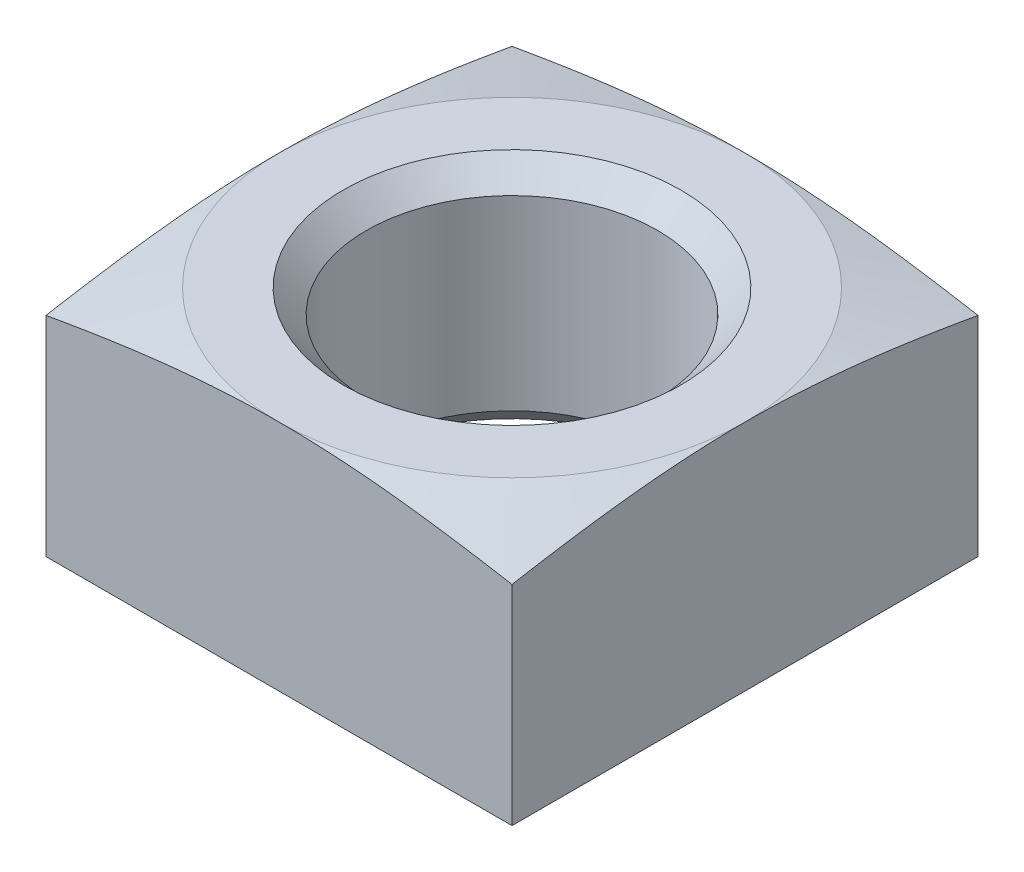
ISO-10303-21;
HEADER;
FILE_DESCRIPTION(('STEP AP214'),'2;1');
FILE_NAME('part.step','',(''),(''),'','','');
FILE_SCHEMA(('AUTOMOTIVE_DESIGN { 1 0 10303 214 1 1 1 1 }'));
ENDSEC;
DATA;
#1=APPLICATION_CONTEXT('core data for automotive mechanical design processes');
#2=APPLICATION_PROTOCOL_DEFINITION('international standard','automotive_design',2000,#1);
#3=PRODUCT_CONTEXT('',#1,'mechanical');
#4=PRODUCT('Part','Part','',(#3));
#5=PRODUCT_RELATED_PRODUCT_CATEGORY('part','',(#4));
#6=PRODUCT_DEFINITION_FORMATION('','',#4);
#7=PRODUCT_DEFINITION_CONTEXT('part definition',#1,'design');
#8=PRODUCT_DEFINITION('design','',#6,#7);
#9=PRODUCT_DEFINITION_SHAPE('','',#8);
#10=(LENGTH_UNIT() NAMED_UNIT(*) SI_UNIT(.MILLI.,.METRE.));
#11=(NAMED_UNIT(*) PLANE_ANGLE_UNIT() SI_UNIT($,.RADIAN.));
#12=(NAMED_UNIT(*) SI_UNIT($,.STERADIAN.) SOLID_ANGLE_UNIT());
#13=UNCERTAINTY_MEASURE_WITH_UNIT(LENGTH_MEASURE(1.E-05),#10,'distance_accuracy_value','');
#14=(GEOMETRIC_REPRESENTATION_CONTEXT(3) GLOBAL_UNCERTAINTY_ASSIGNED_CONTEXT((#13)) GLOBAL_UNIT_ASSIGNED_CONTEXT((#10,
#11,#12)) REPRESENTATION_CONTEXT('',''));
#15=CARTESIAN_POINT('',(0.,0.,0.));
#16=DIRECTION('',(0.,0.,1.));
#17=DIRECTION('',(1.,0.,0.));
#18=AXIS2_PLACEMENT_3D('',#15,#16,#17);
#19=CARTESIAN_POINT('',(4.,2.,4.));
#20=DIRECTION('',(0.,0.,-1.));
#21=DIRECTION('',(0.,1.,0.));
#22=AXIS2_PLACEMENT_3D('',#19,#20,#21);
#23=PLANE('',#22);
#24=DIRECTION('',(0.,-1.,0.));
#25=VECTOR('',#24,1.);
#26=CARTESIAN_POINT('',(4.,2.,4.));
#27=LINE('',#26,#25);
#28=CARTESIAN_POINT('',(4.,1.58578643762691,4.));
#29=VERTEX_POINT('',#28);
#30=CARTESIAN_POINT('',(4.,-2.,3.99999999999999));
#31=VERTEX_POINT('',#30);
#32=EDGE_CURVE('E121',#29,#31,#27,.T.);
#33=ORIENTED_EDGE('',*,*,#32,.F.);
#34=CARTESIAN_POINT('',(-7.9851476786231,0.767252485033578,4.));
#35=CARTESIAN_POINT('',(-7.77802320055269,0.813542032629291,4.));
#36=CARTESIAN_POINT('',(-7.57082419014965,0.859501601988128,4.));
#37=CARTESIAN_POINT('',(-7.15623885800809,0.950582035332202,4.));
#38=CARTESIAN_POINT('',(-6.94885253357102,0.995702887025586,4.));
#39=CARTESIAN_POINT('',(-6.53389438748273,1.08491846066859,4.));
#40=CARTESIAN_POINT('',(-6.3263226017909,1.12901334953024,4.));
#41=CARTESIAN_POINT('',(-5.91091449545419,1.21593901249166,4.));
#42=CARTESIAN_POINT('',(-5.7030781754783,1.25876978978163,4.));
#43=CARTESIAN_POINT('',(-5.2880331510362,1.34265948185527,4.));
#44=CARTESIAN_POINT('',(-5.08082590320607,1.38372558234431,4.));
#45=CARTESIAN_POINT('',(-4.66603009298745,1.46388245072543,4.));
#46=CARTESIAN_POINT('',(-4.45844153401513,1.50297323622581,4.));
#47=CARTESIAN_POINT('',(-4.04270107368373,1.57866436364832,4.));
#48=CARTESIAN_POINT('',(-3.83454894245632,1.61526344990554,4.));
#49=CARTESIAN_POINT('',(-3.41770111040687,1.68525591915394,4.));
#50=CARTESIAN_POINT('',(-3.20900540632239,1.71864928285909,4.));
#51=CARTESIAN_POINT('',(-2.78872915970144,1.78169053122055,4.));
#52=CARTESIAN_POINT('',(-2.57714186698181,1.81129389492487,4.));
#53=CARTESIAN_POINT('',(-2.1532868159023,1.86522601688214,4.));
#54=CARTESIAN_POINT('',(-1.9410190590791,1.88955478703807,4.));
#55=CARTESIAN_POINT('',(-1.51605846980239,1.93169292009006,4.));
#56=CARTESIAN_POINT('',(-1.30336635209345,1.94950935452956,4.));
#57=CARTESIAN_POINT('',(-0.877475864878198,1.97750860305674,4.));
#58=CARTESIAN_POINT('',(-0.664277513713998,1.98769168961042,4.));
#59=CARTESIAN_POINT('',(-0.236898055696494,1.99965898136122,4.));
#60=CARTESIAN_POINT('',(-0.0227161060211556,2.00141391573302,4.));
#61=CARTESIAN_POINT('',(0.405543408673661,1.99629744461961,4.));
#62=CARTESIAN_POINT('',(0.619620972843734,1.98942597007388,4.));
#63=CARTESIAN_POINT('',(1.0475718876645,1.96760541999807,4.));
#64=CARTESIAN_POINT('',(1.26144480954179,1.95264814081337,4.));
#65=CARTESIAN_POINT('',(1.68856985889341,1.91570656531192,4.));
#66=CARTESIAN_POINT('',(1.90182198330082,1.89372223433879,4.));
#67=CARTESIAN_POINT('',(2.41649695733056,1.83359193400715,4.));
#68=CARTESIAN_POINT('',(2.71757536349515,1.79253010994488,4.));
#69=CARTESIAN_POINT('',(3.31848813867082,1.70204998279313,4.));
#70=CARTESIAN_POINT('',(3.61832230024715,1.65263033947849,4.));
#71=CARTESIAN_POINT('',(4.21710819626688,1.54788342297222,4.));
#72=CARTESIAN_POINT('',(4.51605938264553,1.4925530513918,4.));
#73=CARTESIAN_POINT('',(5.1131364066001,1.37773638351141,4.));
#74=CARTESIAN_POINT('',(5.41126229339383,1.31825034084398,4.));
#75=CARTESIAN_POINT('',(6.00745769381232,1.19617970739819,4.));
#76=CARTESIAN_POINT('',(6.30552605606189,1.13358952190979,4.));
#77=CARTESIAN_POINT('',(6.90119590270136,1.00621695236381,4.));
#78=CARTESIAN_POINT('',(7.19879738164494,0.94143454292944,4.));
#79=CARTESIAN_POINT('',(7.79354393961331,0.810254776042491,4.));
#80=CARTESIAN_POINT('',(8.09068913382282,0.743857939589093,4.));
#81=CARTESIAN_POINT('',(8.68469801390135,0.609815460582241,4.));
#82=CARTESIAN_POINT('',(8.98156169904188,0.542169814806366,4.));
#83=CARTESIAN_POINT('',(9.86838288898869,0.338586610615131,4.));
#84=CARTESIAN_POINT('',(10.4580155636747,0.201235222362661,4.));
#85=CARTESIAN_POINT('',(11.6367766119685,-0.0758620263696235,4.));
#86=CARTESIAN_POINT('',(12.2259049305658,-0.215608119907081,4.));
#87=CARTESIAN_POINT('',(13.4014013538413,-0.496129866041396,4.));
#88=CARTESIAN_POINT('',(13.9877709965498,-0.636899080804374,4.));
#89=CARTESIAN_POINT('',(15.1601720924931,-0.919565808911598,4.));
#90=CARTESIAN_POINT('',(15.7462035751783,-1.06146320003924,4.));
#91=CARTESIAN_POINT('',(16.3321487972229,-1.20371178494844,3.99999999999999));
#92=B_SPLINE_CURVE_WITH_KNOTS('',3,(#34,#35,#36,#37,#38,#39,#40,#41,#42,#43,#44,#45,#46,#47,#48,
#49,#50,#51,#52,#53,#54,#55,#56,#57,#58,#59,#60,#61,#62,#63,#64,#65,#66,#67,#68,#69,#70,#71,#72,
#73,#74,#75,#76,#77,#78,#79,#80,#81,#82,#83,#84,#85,#86,#87,#88,#89,#90,#91),.UNSPECIFIED.,.F.,
.F.,(4,2,2,2,2,2,2,2,2,2,2,2,2,2,2,2,2,2,2,2,2,2,2,2,2,2,2,2,4),(0.,0.636702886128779,
1.27341509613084,1.91002298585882,2.5466292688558,3.1803341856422,3.81403345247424,
4.44804973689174,5.08206983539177,5.72296215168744,6.36385302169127,7.00404588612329,
7.64421589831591,8.28660760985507,8.92900446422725,9.5720543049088,10.2151073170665,
11.126524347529,12.0380876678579,12.9501311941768,13.8621191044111,14.7758151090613,
15.6895216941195,16.6029372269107,17.5163551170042,19.3326026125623,21.149027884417,
22.9581168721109,24.7670124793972),.UNSPECIFIED.);
#93=CARTESIAN_POINT('',(0.,2.,4.));
#94=VERTEX_POINT('',#93);
#95=EDGE_CURVE('E98',#29,#94,#92,.F.);
#96=ORIENTED_EDGE('',*,*,#95,.T.);
#97=CARTESIAN_POINT('',(-4.,1.58578643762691,4.));
#98=VERTEX_POINT('',#97);
#99=EDGE_CURVE('E111',#94,#98,#92,.F.);
#100=ORIENTED_EDGE('',*,*,#99,.T.);
#101=DIRECTION('',(0.,-1.,0.));
#102=VECTOR('',#101,1.);
#103=CARTESIAN_POINT('',(-4.,2.,4.));
#104=LINE('',#103,#102);
#105=CARTESIAN_POINT('',(-4.,-2.,3.99999999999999));
#106=VERTEX_POINT('',#105);
#107=EDGE_CURVE('E182',#98,#106,#104,.T.);
#108=ORIENTED_EDGE('',*,*,#107,.T.);
#109=DIRECTION('',(-1.,0.,0.));
#110=VECTOR('',#109,1.);
#111=CARTESIAN_POINT('',(4.,-2.,3.99999999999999));
#112=LINE('',#111,#110);
#113=EDGE_CURVE('E192',#31,#106,#112,.T.);
#114=ORIENTED_EDGE('',*,*,#113,.F.);
#115=EDGE_LOOP('',(#33,#96,#100,#108,#114));
#116=FACE_BOUND('',#115,.T.);
#117=ADVANCED_FACE('F38',(#116),#23,.F.);
#118=CARTESIAN_POINT('',(4.,-2.,-4.));
#119=DIRECTION('',(0.,1.,0.));
#120=DIRECTION('',(0.,0.,1.));
#121=AXIS2_PLACEMENT_3D('',#118,#119,#120);
#122=PLANE('',#121);
#123=CARTESIAN_POINT('',(0.,-2.,0.));
#124=DIRECTION('',(0.,1.,0.));
#125=DIRECTION('',(0.,0.,1.));
#126=AXIS2_PLACEMENT_3D('',#123,#124,#125);
#127=CIRCLE('',#126,2.9);
#128=CARTESIAN_POINT('',(0.,-2.,2.9));
#129=VERTEX_POINT('',#128);
#130=EDGE_CURVE('E11',#129,#129,#127,.T.);
#131=ORIENTED_EDGE('',*,*,#130,.T.);
#132=EDGE_LOOP('',(#131));
#133=FACE_BOUND('',#132,.T.);
#134=DIRECTION('',(0.,0.,-1.));
#135=VECTOR('',#134,1.);
#136=CARTESIAN_POINT('',(-4.,-2.,-4.));
#137=LINE('',#136,#135);
#138=CARTESIAN_POINT('',(-4.,-2.,-4.));
#139=VERTEX_POINT('',#138);
#140=EDGE_CURVE('E185',#106,#139,#137,.T.);
#141=ORIENTED_EDGE('',*,*,#140,.T.);
#142=DIRECTION('',(-1.,0.,0.));
#143=VECTOR('',#142,1.);
#144=CARTESIAN_POINT('',(4.,-2.,-4.));
#145=LINE('',#144,#143);
#146=CARTESIAN_POINT('',(4.,-2.,-4.));
#147=VERTEX_POINT('',#146);
#148=EDGE_CURVE('E181',#147,#139,#145,.T.);
#149=ORIENTED_EDGE('',*,*,#148,.F.);
#150=DIRECTION('',(0.,0.,-1.));
#151=VECTOR('',#150,1.);
#152=CARTESIAN_POINT('',(4.,-2.,-4.));
#153=LINE('',#152,#151);
#154=EDGE_CURVE('E174',#31,#147,#153,.T.);
#155=ORIENTED_EDGE('',*,*,#154,.F.);
#156=ORIENTED_EDGE('',*,*,#113,.T.);
#157=EDGE_LOOP('',(#141,#149,#155,#156));
#158=FACE_BOUND('',#157,.T.);
#159=ADVANCED_FACE('F224',(#133,#158),#122,.F.);
#160=CARTESIAN_POINT('',(4.,2.,-4.00000000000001));
#161=DIRECTION('',(0.,0.,1.));
#162=DIRECTION('',(0.,-1.,0.));
#163=AXIS2_PLACEMENT_3D('',#160,#161,#162);
#164=PLANE('',#163);
#165=DIRECTION('',(0.,1.,0.));
#166=VECTOR('',#165,1.);
#167=CARTESIAN_POINT('',(-4.,2.,-4.00000000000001));
#168=LINE('',#167,#166);
#169=CARTESIAN_POINT('',(-4.,1.58578643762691,-4.00000000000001));
#170=VERTEX_POINT('',#169);
#171=EDGE_CURVE('E175',#139,#170,#168,.T.);
#172=ORIENTED_EDGE('',*,*,#171,.T.);
#173=CARTESIAN_POINT('',(-7.9851476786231,0.767252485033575,-4.));
#174=CARTESIAN_POINT('',(-7.7780232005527,0.813542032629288,-4.));
#175=CARTESIAN_POINT('',(-7.57082419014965,0.859501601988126,-4.));
#176=CARTESIAN_POINT('',(-7.15623885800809,0.9505820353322,-4.));
#177=CARTESIAN_POINT('',(-6.94885253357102,0.995702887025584,-4.00000000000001));
#178=CARTESIAN_POINT('',(-6.53389438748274,1.08491846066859,-4.00000000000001));
#179=CARTESIAN_POINT('',(-6.3263226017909,1.12901334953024,-4.00000000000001));
#180=CARTESIAN_POINT('',(-5.9109144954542,1.21593901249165,-4.00000000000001));
#181=CARTESIAN_POINT('',(-5.7030781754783,1.25876978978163,-4.00000000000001));
#182=CARTESIAN_POINT('',(-5.28803315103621,1.34265948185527,-4.00000000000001));
#183=CARTESIAN_POINT('',(-5.08082590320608,1.38372558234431,-4.00000000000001));
#184=CARTESIAN_POINT('',(-4.66603009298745,1.46388245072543,-4.00000000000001));
#185=CARTESIAN_POINT('',(-4.45844153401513,1.50297323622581,-4.00000000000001));
#186=CARTESIAN_POINT('',(-4.04270107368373,1.57866436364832,-4.00000000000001));
#187=CARTESIAN_POINT('',(-3.83454894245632,1.61526344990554,-4.00000000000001));
#188=CARTESIAN_POINT('',(-3.41770111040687,1.68525591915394,-4.00000000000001));
#189=CARTESIAN_POINT('',(-3.20900540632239,1.71864928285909,-4.00000000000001));
#190=CARTESIAN_POINT('',(-2.78872915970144,1.78169053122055,-4.00000000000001));
#191=CARTESIAN_POINT('',(-2.5771418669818,1.81129389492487,-4.00000000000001));
#192=CARTESIAN_POINT('',(-2.15328681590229,1.86522601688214,-4.00000000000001));
#193=CARTESIAN_POINT('',(-1.9410190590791,1.88955478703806,-4.00000000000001));
#194=CARTESIAN_POINT('',(-1.51605846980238,1.93169292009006,-4.00000000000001));
#195=CARTESIAN_POINT('',(-1.30336635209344,1.94950935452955,-4.00000000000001));
#196=CARTESIAN_POINT('',(-0.877475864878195,1.97750860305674,-4.00000000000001));
#197=CARTESIAN_POINT('',(-0.664277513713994,1.98769168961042,-4.00000000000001));
#198=CARTESIAN_POINT('',(-0.236898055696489,1.99965898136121,-4.00000000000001));
#199=CARTESIAN_POINT('',(-0.0227161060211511,2.00141391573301,-4.00000000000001));
#200=CARTESIAN_POINT('',(0.405543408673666,1.9962974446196,-4.00000000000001));
#201=CARTESIAN_POINT('',(0.619620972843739,1.98942597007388,-4.00000000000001));
#202=CARTESIAN_POINT('',(1.04757188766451,1.96760541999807,-4.00000000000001));
#203=CARTESIAN_POINT('',(1.2614448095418,1.95264814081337,-4.00000000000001));
#204=CARTESIAN_POINT('',(1.68856985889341,1.91570656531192,-4.00000000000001));
#205=CARTESIAN_POINT('',(1.90182198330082,1.89372223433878,-4.00000000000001));
#206=CARTESIAN_POINT('',(2.41649695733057,1.83359193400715,-4.00000000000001));
#207=CARTESIAN_POINT('',(2.71757536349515,1.79253010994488,-4.00000000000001));
#208=CARTESIAN_POINT('',(3.31848813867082,1.70204998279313,-4.00000000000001));
#209=CARTESIAN_POINT('',(3.61832230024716,1.65263033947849,-4.00000000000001));
#210=CARTESIAN_POINT('',(4.21710819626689,1.54788342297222,-4.00000000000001));
#211=CARTESIAN_POINT('',(4.51605938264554,1.4925530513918,-4.00000000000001));
#212=CARTESIAN_POINT('',(5.11313640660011,1.37773638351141,-4.00000000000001));
#213=CARTESIAN_POINT('',(5.41126229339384,1.31825034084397,-4.00000000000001));
#214=CARTESIAN_POINT('',(6.00745769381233,1.19617970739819,-4.00000000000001));
#215=CARTESIAN_POINT('',(6.30552605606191,1.13358952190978,-4.00000000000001));
#216=CARTESIAN_POINT('',(6.90119590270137,1.00621695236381,-4.00000000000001));
#217=CARTESIAN_POINT('',(7.19879738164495,0.941434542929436,-4.));
#218=CARTESIAN_POINT('',(7.79354393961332,0.810254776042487,-4.));
#219=CARTESIAN_POINT('',(8.09068913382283,0.743857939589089,-4.));
#220=CARTESIAN_POINT('',(8.68469801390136,0.609815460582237,-4.));
#221=CARTESIAN_POINT('',(8.9815616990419,0.542169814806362,-4.));
#222=CARTESIAN_POINT('',(9.86838288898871,0.338586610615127,-4.));
#223=CARTESIAN_POINT('',(10.4580155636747,0.201235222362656,-4.));
#224=CARTESIAN_POINT('',(11.6367766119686,-0.0758620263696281,-4.));
#225=CARTESIAN_POINT('',(12.2259049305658,-0.215608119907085,-4.));
#226=CARTESIAN_POINT('',(13.4014013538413,-0.496129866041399,-4.));
#227=CARTESIAN_POINT('',(13.9877709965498,-0.636899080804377,-4.));
#228=CARTESIAN_POINT('',(15.1601720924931,-0.9195658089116,-4.));
#229=CARTESIAN_POINT('',(15.7462035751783,-1.06146320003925,-4.));
#230=CARTESIAN_POINT('',(16.332148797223,-1.20371178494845,-4.));
#231=B_SPLINE_CURVE_WITH_KNOTS('',3,(#173,#174,#175,#176,#177,#178,#179,#180,#181,#182,#183,
#184,#185,#186,#187,#188,#189,#190,#191,#192,#193,#194,#195,#196,#197,#198,#199,#200,#201,#202,
#203,#204,#205,#206,#207,#208,#209,#210,#211,#212,#213,#214,#215,#216,#217,#218,#219,#220,#221,
#222,#223,#224,#225,#226,#227,#228,#229,#230),.UNSPECIFIED.,.F.,.F.,(4,2,2,2,2,2,2,2,2,2,2,2,2,
2,2,2,2,2,2,2,2,2,2,2,2,2,2,2,4),(0.,0.636702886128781,1.27341509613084,1.91002298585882,
2.54662926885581,3.1803341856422,3.81403345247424,4.44804973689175,5.08206983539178,
5.72296215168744,6.36385302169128,7.0040458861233,7.64421589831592,8.28660760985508,
8.92900446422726,9.57205430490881,10.2151073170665,11.126524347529,12.0380876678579,
12.9501311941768,13.8621191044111,14.7758151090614,15.6895216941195,16.6029372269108,
17.5163551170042,19.3326026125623,21.149027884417,22.9581168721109,24.7670124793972),.UNSPECIFIED.);
#232=CARTESIAN_POINT('',(0.,2.,-4.00000000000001));
#233=VERTEX_POINT('',#232);
#234=EDGE_CURVE('E61',#170,#233,#231,.T.);
#235=ORIENTED_EDGE('',*,*,#234,.T.);
#236=CARTESIAN_POINT('',(4.,1.58578643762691,-4.00000000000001));
#237=VERTEX_POINT('',#236);
#238=EDGE_CURVE('E136',#233,#237,#231,.T.);
#239=ORIENTED_EDGE('',*,*,#238,.T.);
#240=DIRECTION('',(0.,1.,0.));
#241=VECTOR('',#240,1.);
#242=CARTESIAN_POINT('',(4.,2.,-4.00000000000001));
#243=LINE('',#242,#241);
#244=EDGE_CURVE('E177',#147,#237,#243,.T.);
#245=ORIENTED_EDGE('',*,*,#244,.F.);
#246=ORIENTED_EDGE('',*,*,#148,.T.);
#247=EDGE_LOOP('',(#172,#235,#239,#245,#246));
#248=FACE_BOUND('',#247,.T.);
#249=ADVANCED_FACE('F142',(#248),#164,.F.);
#250=CARTESIAN_POINT('',(4.,0.,0.));
#251=DIRECTION('',(-1.,0.,0.));
#252=DIRECTION('',(0.,0.,1.));
#253=AXIS2_PLACEMENT_3D('',#250,#251,#252);
#254=PLANE('',#253);
#255=ORIENTED_EDGE('',*,*,#244,.T.);
#256=CARTESIAN_POINT('',(4.,0.767252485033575,-7.98514767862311));
#257=CARTESIAN_POINT('',(4.,0.813542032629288,-7.7780232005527));
#258=CARTESIAN_POINT('',(4.,0.859501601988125,-7.57082419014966));
#259=CARTESIAN_POINT('',(4.,0.950582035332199,-7.1562388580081));
#260=CARTESIAN_POINT('',(4.,0.995702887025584,-6.94885253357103));
#261=CARTESIAN_POINT('',(4.,1.08491846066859,-6.53389438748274));
#262=CARTESIAN_POINT('',(4.,1.12901334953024,-6.32632260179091));
#263=CARTESIAN_POINT('',(4.,1.21593901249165,-5.9109144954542));
#264=CARTESIAN_POINT('',(4.,1.25876978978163,-5.70307817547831));
#265=CARTESIAN_POINT('',(4.,1.34265948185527,-5.28803315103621));
#266=CARTESIAN_POINT('',(4.,1.38372558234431,-5.08082590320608));
#267=CARTESIAN_POINT('',(4.,1.46388245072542,-4.66603009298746));
#268=CARTESIAN_POINT('',(4.,1.50297323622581,-4.45844153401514));
#269=CARTESIAN_POINT('',(4.,1.57866436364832,-4.04270107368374));
#270=CARTESIAN_POINT('',(4.,1.61526344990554,-3.83454894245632));
#271=CARTESIAN_POINT('',(4.,1.68525591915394,-3.41770111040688));
#272=CARTESIAN_POINT('',(4.,1.71864928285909,-3.2090054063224));
#273=CARTESIAN_POINT('',(4.,1.78169053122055,-2.78872915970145));
#274=CARTESIAN_POINT('',(4.,1.81129389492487,-2.57714186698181));
#275=CARTESIAN_POINT('',(4.,1.86522601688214,-2.1532868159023));
#276=CARTESIAN_POINT('',(4.,1.88955478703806,-1.9410190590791));
#277=CARTESIAN_POINT('',(4.,1.93169292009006,-1.51605846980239));
#278=CARTESIAN_POINT('',(4.,1.94950935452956,-1.30336635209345));
#279=CARTESIAN_POINT('',(4.,1.97750860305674,-0.877475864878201));
#280=CARTESIAN_POINT('',(4.,1.98769168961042,-0.664277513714));
#281=CARTESIAN_POINT('',(4.,1.99965898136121,-0.236898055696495));
#282=CARTESIAN_POINT('',(4.,2.00141391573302,-0.0227161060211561));
#283=CARTESIAN_POINT('',(4.,1.9962974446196,0.405543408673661));
#284=CARTESIAN_POINT('',(4.,1.98942597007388,0.619620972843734));
#285=CARTESIAN_POINT('',(4.,1.96760541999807,1.0475718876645));
#286=CARTESIAN_POINT('',(4.,1.95264814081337,1.26144480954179));
#287=CARTESIAN_POINT('',(4.,1.91570656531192,1.68856985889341));
#288=CARTESIAN_POINT('',(4.,1.89372223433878,1.90182198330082));
#289=CARTESIAN_POINT('',(4.,1.83359193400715,2.41649695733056));
#290=CARTESIAN_POINT('',(4.,1.79253010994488,2.71757536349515));
#291=CARTESIAN_POINT('',(4.,1.70204998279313,3.31848813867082));
#292=CARTESIAN_POINT('',(4.,1.65263033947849,3.61832230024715));
#293=CARTESIAN_POINT('',(4.,1.54788342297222,4.21710819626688));
#294=CARTESIAN_POINT('',(4.,1.4925530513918,4.51605938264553));
#295=CARTESIAN_POINT('',(4.,1.37773638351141,5.1131364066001));
#296=CARTESIAN_POINT('',(4.,1.31825034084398,5.41126229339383));
#297=CARTESIAN_POINT('',(4.,1.19617970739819,6.00745769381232));
#298=CARTESIAN_POINT('',(4.,1.13358952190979,6.30552605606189));
#299=CARTESIAN_POINT('',(4.,1.00621695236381,6.90119590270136));
#300=CARTESIAN_POINT('',(4.,0.94143454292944,7.19879738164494));
#301=CARTESIAN_POINT('',(4.,0.810254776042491,7.7935439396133));
#302=CARTESIAN_POINT('',(4.,0.743857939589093,8.09068913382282));
#303=CARTESIAN_POINT('',(4.,0.609815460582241,8.68469801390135));
#304=CARTESIAN_POINT('',(4.,0.542169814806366,8.98156169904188));
#305=CARTESIAN_POINT('',(4.,0.338586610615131,9.86838288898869));
#306=CARTESIAN_POINT('',(4.,0.201235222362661,10.4580155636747));
#307=CARTESIAN_POINT('',(4.,-0.0758620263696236,11.6367766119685));
#308=CARTESIAN_POINT('',(4.,-0.215608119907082,12.2259049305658));
#309=CARTESIAN_POINT('',(4.,-0.496129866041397,13.4014013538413));
#310=CARTESIAN_POINT('',(4.,-0.636899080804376,13.9877709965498));
#311=CARTESIAN_POINT('',(4.,-0.9195658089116,15.1601720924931));
#312=CARTESIAN_POINT('',(4.,-1.06146320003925,15.7462035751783));
#313=CARTESIAN_POINT('',(4.,-1.20371178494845,16.3321487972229));
#314=B_SPLINE_CURVE_WITH_KNOTS('',3,(#256,#257,#258,#259,#260,#261,#262,#263,#264,#265,#266,
#267,#268,#269,#270,#271,#272,#273,#274,#275,#276,#277,#278,#279,#280,#281,#282,#283,#284,#285,
#286,#287,#288,#289,#290,#291,#292,#293,#294,#295,#296,#297,#298,#299,#300,#301,#302,#303,#304,
#305,#306,#307,#308,#309,#310,#311,#312,#313),.UNSPECIFIED.,.F.,.F.,(4,2,2,2,2,2,2,2,2,2,2,2,2,
2,2,2,2,2,2,2,2,2,2,2,2,2,2,2,4),(0.,0.63670288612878,1.27341509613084,1.91002298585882,
2.5466292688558,3.1803341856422,3.81403345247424,4.44804973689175,5.08206983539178,
5.72296215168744,6.36385302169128,7.0040458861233,7.64421589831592,8.28660760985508,
8.92900446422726,9.57205430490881,10.2151073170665,11.126524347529,12.0380876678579,
12.9501311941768,13.8621191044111,14.7758151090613,15.6895216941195,16.6029372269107,
17.5163551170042,19.3326026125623,21.149027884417,22.9581168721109,24.7670124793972),.UNSPECIFIED.);
#315=CARTESIAN_POINT('',(4.,2.,0.));
#316=VERTEX_POINT('',#315);
#317=EDGE_CURVE('E171',#237,#316,#314,.T.);
#318=ORIENTED_EDGE('',*,*,#317,.T.);
#319=EDGE_CURVE('E100',#316,#29,#314,.T.);
#320=ORIENTED_EDGE('',*,*,#319,.T.);
#321=ORIENTED_EDGE('',*,*,#32,.T.);
#322=ORIENTED_EDGE('',*,*,#154,.T.);
#323=EDGE_LOOP('',(#255,#318,#320,#321,#322));
#324=FACE_BOUND('',#323,.T.);
#325=ADVANCED_FACE('F154',(#324),#254,.F.);
#326=CARTESIAN_POINT('',(-4.,0.,0.));
#327=DIRECTION('',(-1.,0.,0.));
#328=DIRECTION('',(0.,0.,1.));
#329=AXIS2_PLACEMENT_3D('',#326,#327,#328);
#330=PLANE('',#329);
#331=CARTESIAN_POINT('',(-4.,0.767252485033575,-7.98514767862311));
#332=CARTESIAN_POINT('',(-4.,0.813542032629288,-7.7780232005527));
#333=CARTESIAN_POINT('',(-4.,0.859501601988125,-7.57082419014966));
#334=CARTESIAN_POINT('',(-4.,0.950582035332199,-7.1562388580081));
#335=CARTESIAN_POINT('',(-4.,0.995702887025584,-6.94885253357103));
#336=CARTESIAN_POINT('',(-4.,1.08491846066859,-6.53389438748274));
#337=CARTESIAN_POINT('',(-4.,1.12901334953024,-6.32632260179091));
#338=CARTESIAN_POINT('',(-4.,1.21593901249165,-5.9109144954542));
#339=CARTESIAN_POINT('',(-4.,1.25876978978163,-5.70307817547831));
#340=CARTESIAN_POINT('',(-4.,1.34265948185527,-5.28803315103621));
#341=CARTESIAN_POINT('',(-4.,1.38372558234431,-5.08082590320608));
#342=CARTESIAN_POINT('',(-4.,1.46388245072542,-4.66603009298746));
#343=CARTESIAN_POINT('',(-4.,1.50297323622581,-4.45844153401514));
#344=CARTESIAN_POINT('',(-4.,1.57866436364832,-4.04270107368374));
#345=CARTESIAN_POINT('',(-4.,1.61526344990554,-3.83454894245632));
#346=CARTESIAN_POINT('',(-4.,1.68525591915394,-3.41770111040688));
#347=CARTESIAN_POINT('',(-4.,1.71864928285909,-3.2090054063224));
#348=CARTESIAN_POINT('',(-4.,1.78169053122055,-2.78872915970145));
#349=CARTESIAN_POINT('',(-4.,1.81129389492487,-2.57714186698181));
#350=CARTESIAN_POINT('',(-4.,1.86522601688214,-2.1532868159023));
#351=CARTESIAN_POINT('',(-4.,1.88955478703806,-1.9410190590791));
#352=CARTESIAN_POINT('',(-4.,1.93169292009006,-1.51605846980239));
#353=CARTESIAN_POINT('',(-4.,1.94950935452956,-1.30336635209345));
#354=CARTESIAN_POINT('',(-4.,1.97750860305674,-0.877475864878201));
#355=CARTESIAN_POINT('',(-4.,1.98769168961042,-0.664277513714));
#356=CARTESIAN_POINT('',(-4.,1.99965898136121,-0.236898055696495));
#357=CARTESIAN_POINT('',(-4.,2.00141391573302,-0.0227161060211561));
#358=CARTESIAN_POINT('',(-4.,1.9962974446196,0.405543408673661));
#359=CARTESIAN_POINT('',(-4.,1.98942597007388,0.619620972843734));
#360=CARTESIAN_POINT('',(-4.,1.96760541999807,1.0475718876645));
#361=CARTESIAN_POINT('',(-4.,1.95264814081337,1.26144480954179));
#362=CARTESIAN_POINT('',(-4.,1.91570656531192,1.68856985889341));
#363=CARTESIAN_POINT('',(-4.,1.89372223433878,1.90182198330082));
#364=CARTESIAN_POINT('',(-4.,1.83359193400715,2.41649695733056));
#365=CARTESIAN_POINT('',(-4.,1.79253010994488,2.71757536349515));
#366=CARTESIAN_POINT('',(-4.,1.70204998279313,3.31848813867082));
#367=CARTESIAN_POINT('',(-4.,1.65263033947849,3.61832230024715));
#368=CARTESIAN_POINT('',(-4.,1.54788342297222,4.21710819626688));
#369=CARTESIAN_POINT('',(-4.,1.4925530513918,4.51605938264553));
#370=CARTESIAN_POINT('',(-4.,1.37773638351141,5.1131364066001));
#371=CARTESIAN_POINT('',(-4.,1.31825034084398,5.41126229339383));
#372=CARTESIAN_POINT('',(-4.,1.19617970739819,6.00745769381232));
#373=CARTESIAN_POINT('',(-4.,1.13358952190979,6.30552605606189));
#374=CARTESIAN_POINT('',(-4.,1.00621695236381,6.90119590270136));
#375=CARTESIAN_POINT('',(-4.,0.94143454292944,7.19879738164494));
#376=CARTESIAN_POINT('',(-4.,0.810254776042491,7.7935439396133));
#377=CARTESIAN_POINT('',(-4.,0.743857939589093,8.09068913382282));
#378=CARTESIAN_POINT('',(-4.,0.609815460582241,8.68469801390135));
#379=CARTESIAN_POINT('',(-4.,0.542169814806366,8.98156169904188));
#380=CARTESIAN_POINT('',(-4.,0.338586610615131,9.86838288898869));
#381=CARTESIAN_POINT('',(-4.,0.201235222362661,10.4580155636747));
#382=CARTESIAN_POINT('',(-4.,-0.0758620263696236,11.6367766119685));
#383=CARTESIAN_POINT('',(-4.,-0.215608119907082,12.2259049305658));
#384=CARTESIAN_POINT('',(-4.,-0.496129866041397,13.4014013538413));
#385=CARTESIAN_POINT('',(-4.,-0.636899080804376,13.9877709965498));
#386=CARTESIAN_POINT('',(-4.,-0.9195658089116,15.1601720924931));
#387=CARTESIAN_POINT('',(-4.,-1.06146320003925,15.7462035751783));
#388=CARTESIAN_POINT('',(-4.,-1.20371178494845,16.3321487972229));
#389=B_SPLINE_CURVE_WITH_KNOTS('',3,(#331,#332,#333,#334,#335,#336,#337,#338,#339,#340,#341,
#342,#343,#344,#345,#346,#347,#348,#349,#350,#351,#352,#353,#354,#355,#356,#357,#358,#359,#360,
#361,#362,#363,#364,#365,#366,#367,#368,#369,#370,#371,#372,#373,#374,#375,#376,#377,#378,#379,
#380,#381,#382,#383,#384,#385,#386,#387,#388),.UNSPECIFIED.,.F.,.F.,(4,2,2,2,2,2,2,2,2,2,2,2,2,
2,2,2,2,2,2,2,2,2,2,2,2,2,2,2,4),(0.,0.63670288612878,1.27341509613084,1.91002298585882,
2.5466292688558,3.1803341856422,3.81403345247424,4.44804973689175,5.08206983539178,
5.72296215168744,6.36385302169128,7.0040458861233,7.64421589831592,8.28660760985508,
8.92900446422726,9.57205430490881,10.2151073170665,11.126524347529,12.0380876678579,
12.9501311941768,13.8621191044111,14.7758151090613,15.6895216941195,16.6029372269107,
17.5163551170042,19.3326026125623,21.149027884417,22.9581168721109,24.7670124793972),.UNSPECIFIED.);
#390=CARTESIAN_POINT('',(-4.,2.,0.));
#391=VERTEX_POINT('',#390);
#392=EDGE_CURVE('E54',#170,#391,#389,.T.);
#393=ORIENTED_EDGE('',*,*,#392,.F.);
#394=ORIENTED_EDGE('',*,*,#171,.F.);
#395=ORIENTED_EDGE('',*,*,#140,.F.);
#396=ORIENTED_EDGE('',*,*,#107,.F.);
#397=EDGE_CURVE('E114',#391,#98,#389,.T.);
#398=ORIENTED_EDGE('',*,*,#397,.F.);
#399=EDGE_LOOP('',(#393,#394,#395,#396,#398));
#400=FACE_BOUND('',#399,.T.);
#401=ADVANCED_FACE('F239',(#400),#330,.T.);
#402=CARTESIAN_POINT('',(0.,1.5,0.));
#403=DIRECTION('',(0.,-1.,0.));
#404=DIRECTION('',(0.,0.,-1.));
#405=AXIS2_PLACEMENT_3D('',#402,#403,#404);
#406=CONICAL_SURFACE('',#405,6.,1.32581766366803);
#407=CARTESIAN_POINT('',(0.,2.,0.));
#408=DIRECTION('',(0.,1.,0.));
#409=DIRECTION('',(0.,0.,1.));
#410=AXIS2_PLACEMENT_3D('',#407,#408,#409);
#411=CIRCLE('',#410,4.);
#412=EDGE_CURVE('E108',#391,#94,#411,.T.);
#413=ORIENTED_EDGE('',*,*,#412,.F.);
#414=ORIENTED_EDGE('',*,*,#397,.T.);
#415=ORIENTED_EDGE('',*,*,#99,.F.);
#416=EDGE_LOOP('',(#413,#414,#415));
#417=FACE_BOUND('',#416,.T.);
#418=ADVANCED_FACE('F112',(#417),#406,.T.);
#419=ORIENTED_EDGE('',*,*,#392,.T.);
#420=EDGE_CURVE('E125',#233,#391,#411,.T.);
#421=ORIENTED_EDGE('',*,*,#420,.F.);
#422=ORIENTED_EDGE('',*,*,#234,.F.);
#423=EDGE_LOOP('',(#419,#421,#422));
#424=FACE_BOUND('',#423,.T.);
#425=ADVANCED_FACE('F152',(#424),#406,.T.);
#426=EDGE_CURVE('E94',#94,#316,#411,.T.);
#427=ORIENTED_EDGE('',*,*,#426,.F.);
#428=ORIENTED_EDGE('',*,*,#95,.F.);
#429=ORIENTED_EDGE('',*,*,#319,.F.);
#430=EDGE_LOOP('',(#427,#428,#429));
#431=FACE_BOUND('',#430,.T.);
#432=ADVANCED_FACE('F96',(#431),#406,.T.);
#433=EDGE_CURVE('E106',#316,#233,#411,.T.);
#434=ORIENTED_EDGE('',*,*,#433,.F.);
#435=ORIENTED_EDGE('',*,*,#317,.F.);
#436=ORIENTED_EDGE('',*,*,#238,.F.);
#437=EDGE_LOOP('',(#434,#435,#436));
#438=FACE_BOUND('',#437,.T.);
#439=ADVANCED_FACE('F146',(#438),#406,.T.);
#440=CARTESIAN_POINT('',(4.,2.,-4.00000000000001));
#441=DIRECTION('',(0.,-1.,0.));
#442=DIRECTION('',(0.,0.,-1.));
#443=AXIS2_PLACEMENT_3D('',#440,#441,#442);
#444=PLANE('',#443);
#445=CARTESIAN_POINT('',(0.,2.,0.));
#446=DIRECTION('',(0.,-1.,0.));
#447=DIRECTION('',(0.,0.,-1.));
#448=AXIS2_PLACEMENT_3D('',#445,#446,#447);
#449=CIRCLE('',#448,2.9);
#450=CARTESIAN_POINT('',(0.,2.,-2.9));
#451=VERTEX_POINT('',#450);
#452=EDGE_CURVE('E47',#451,#451,#449,.T.);
#453=ORIENTED_EDGE('',*,*,#452,.T.);
#454=EDGE_LOOP('',(#453));
#455=FACE_BOUND('',#454,.T.);
#456=ORIENTED_EDGE('',*,*,#433,.T.);
#457=ORIENTED_EDGE('',*,*,#420,.T.);
#458=ORIENTED_EDGE('',*,*,#412,.T.);
#459=ORIENTED_EDGE('',*,*,#426,.T.);
#460=EDGE_LOOP('',(#456,#457,#458,#459));
#461=FACE_BOUND('',#460,.T.);
#462=ADVANCED_FACE('F124',(#455,#461),#444,.F.);
#463=CARTESIAN_POINT('',(0.,-9.07106781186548,0.));
#464=DIRECTION('',(0.,1.,0.));
#465=DIRECTION('',(0.,0.,1.));
#466=AXIS2_PLACEMENT_3D('',#463,#464,#465);
#467=CYLINDRICAL_SURFACE('',#466,2.5);
#468=CARTESIAN_POINT('',(0.,1.6,0.));
#469=DIRECTION('',(0.,-1.,0.));
#470=DIRECTION('',(0.,0.,-1.));
#471=AXIS2_PLACEMENT_3D('',#468,#469,#470);
#472=CIRCLE('',#471,2.5);
#473=CARTESIAN_POINT('',(0.,1.6,-2.5));
#474=VERTEX_POINT('',#473);
#475=EDGE_CURVE('E203',#474,#474,#472,.F.);
#476=ORIENTED_EDGE('',*,*,#475,.T.);
#477=EDGE_LOOP('',(#476));
#478=FACE_BOUND('',#477,.T.);
#479=CARTESIAN_POINT('',(0.,-1.6,0.));
#480=DIRECTION('',(0.,1.,0.));
#481=DIRECTION('',(0.,0.,1.));
#482=AXIS2_PLACEMENT_3D('',#479,#480,#481);
#483=CIRCLE('',#482,2.5);
#484=CARTESIAN_POINT('',(0.,-1.6,2.5));
#485=VERTEX_POINT('',#484);
#486=EDGE_CURVE('E200',#485,#485,#483,.F.);
#487=ORIENTED_EDGE('',*,*,#486,.T.);
#488=EDGE_LOOP('',(#487));
#489=FACE_BOUND('',#488,.T.);
#490=ADVANCED_FACE('F153',(#478,#489),#467,.F.);
#491=CARTESIAN_POINT('',(0.,1.6,0.));
#492=DIRECTION('',(0.,1.,0.));
#493=DIRECTION('',(0.,0.,1.));
#494=AXIS2_PLACEMENT_3D('',#491,#492,#493);
#495=CONICAL_SURFACE('',#494,2.5,0.785398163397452);
#496=ORIENTED_EDGE('',*,*,#452,.F.);
#497=EDGE_LOOP('',(#496));
#498=FACE_BOUND('',#497,.T.);
#499=ORIENTED_EDGE('',*,*,#475,.F.);
#500=EDGE_LOOP('',(#499));
#501=FACE_BOUND('',#500,.T.);
#502=ADVANCED_FACE('F214',(#498,#501),#495,.F.);
#503=CARTESIAN_POINT('',(0.,-1.6,0.));
#504=DIRECTION('',(0.,-1.,0.));
#505=DIRECTION('',(0.,0.,-1.));
#506=AXIS2_PLACEMENT_3D('',#503,#504,#505);
#507=CONICAL_SURFACE('',#506,2.5,0.78539816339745);
#508=ORIENTED_EDGE('',*,*,#130,.F.);
#509=EDGE_LOOP('',(#508));
#510=FACE_BOUND('',#509,.T.);
#511=ORIENTED_EDGE('',*,*,#486,.F.);
#512=EDGE_LOOP('',(#511));
#513=FACE_BOUND('',#512,.T.);
#514=ADVANCED_FACE('F40',(#510,#513),#507,.F.);
#515=CLOSED_SHELL('',(#117,#159,#249,#325,#401,#418,#425,#432,#439,#462,#490,#502,#514));
#516=MANIFOLD_SOLID_BREP('B2',#515);
#517=ADVANCED_BREP_SHAPE_REPRESENTATION('',(#18,#516),#14);
#518=SHAPE_DEFINITION_REPRESENTATION(#9,#517);
ENDSEC;
END-ISO-10303-21;
